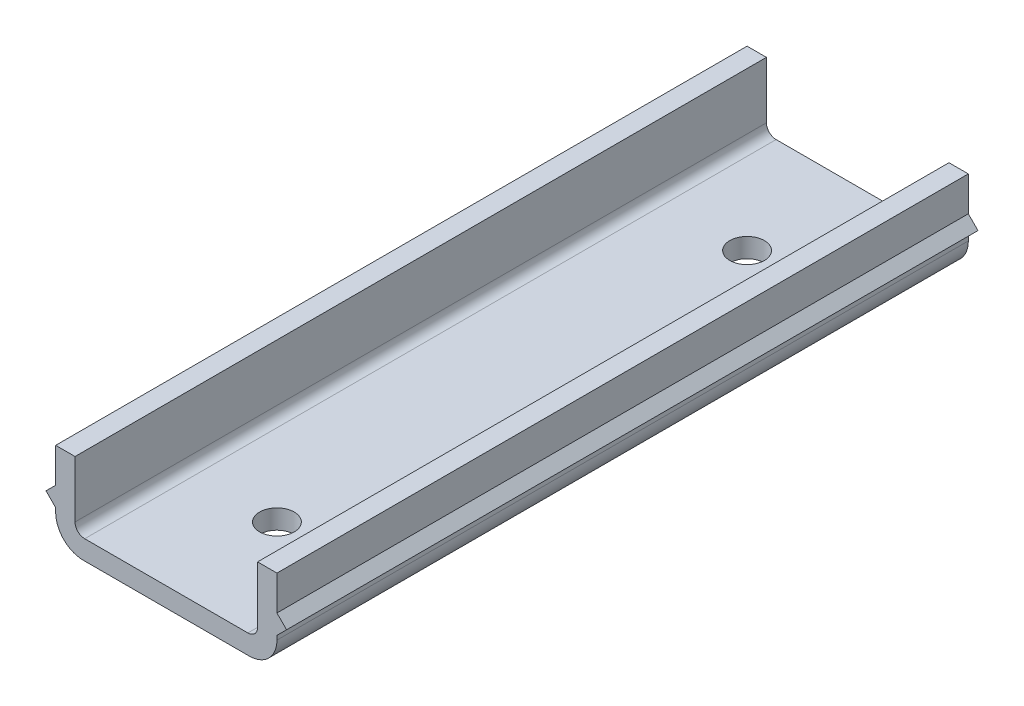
from build123d import *

# Parameters (mm, degrees)
EXTRUDE3_DEPTH        = 50
FILLET1_R             = 2
FILLET2_R             = 0.7
FILLET1_OF_MIRROR1_R  = 2
FILLET2_OF_MIRROR1_R  = 0.7
M3X0_5_TAPPED_HOLE1_D = 2.5
LPATTERN1_COUNT       = 2
LPATTERN1_PITCH       = 34


with BuildPart() as part:
    # Sketch2 → Extrude3 (new body)
    with BuildSketch(Plane.XY):
        Polygon((6.6, 6.2), (8, 6.2), (8, 3.7), (8.7, 3), (8, 2.3), (8, 0), (0, 0), (0, 1.4), (6.6, 1.4), align=None)
    extrude3 = extrude(amount=EXTRUDE3_DEPTH)

    # Fillet1
    fillet1_edges = [part.edges().sort_by_distance(p)[0] for p in [
        (8, 0, 25),
    ]]
    fillet(fillet1_edges, radius=FILLET1_R)

    # Fillet2
    fillet2_edges = [part.edges().sort_by_distance(p)[0] for p in [
        (6.6, 1.4, 25),
    ]]
    fillet(fillet2_edges, radius=FILLET2_R)

    # Mirror1: Extrude3 across plane
    add(extrude3.mirror(Plane(origin=(0, 0, 0), x_dir=(0, 0, 1), z_dir=(1, 0, 0))))

    # Fillet1 of Mirror1
    fillet1_of_mirror1_edges = [part.edges().sort_by_distance(p)[0] for p in [
        (-8, 0, 25),
    ]]
    fillet(fillet1_of_mirror1_edges, radius=FILLET1_OF_MIRROR1_R)

    # Fillet2 of Mirror1
    fillet2_of_mirror1_edges = [part.edges().sort_by_distance(p)[0] for p in [
        (-6.6, 1.4, 25),
    ]]
    fillet(fillet2_of_mirror1_edges, radius=FILLET2_OF_MIRROR1_R)

    # M3x0.5 Tapped Hole1 (through all)
    with Locations(Plane(origin=(0, 6.2, 0), x_dir=(-1, 0, 0), z_dir=(0, 1, 0))):
        with Locations((0, 8)):
            m3x0_5_tapped_hole1 = Hole(M3X0_5_TAPPED_HOLE1_D / 2)

    # LPattern1: M3x0.5 Tapped Hole1 ×2
    with Locations(*[(0, 0, i * LPATTERN1_PITCH) for i in range(1, LPATTERN1_COUNT)]):
        add(m3x0_5_tapped_hole1, mode=Mode.SUBTRACT)


solid = part.part
